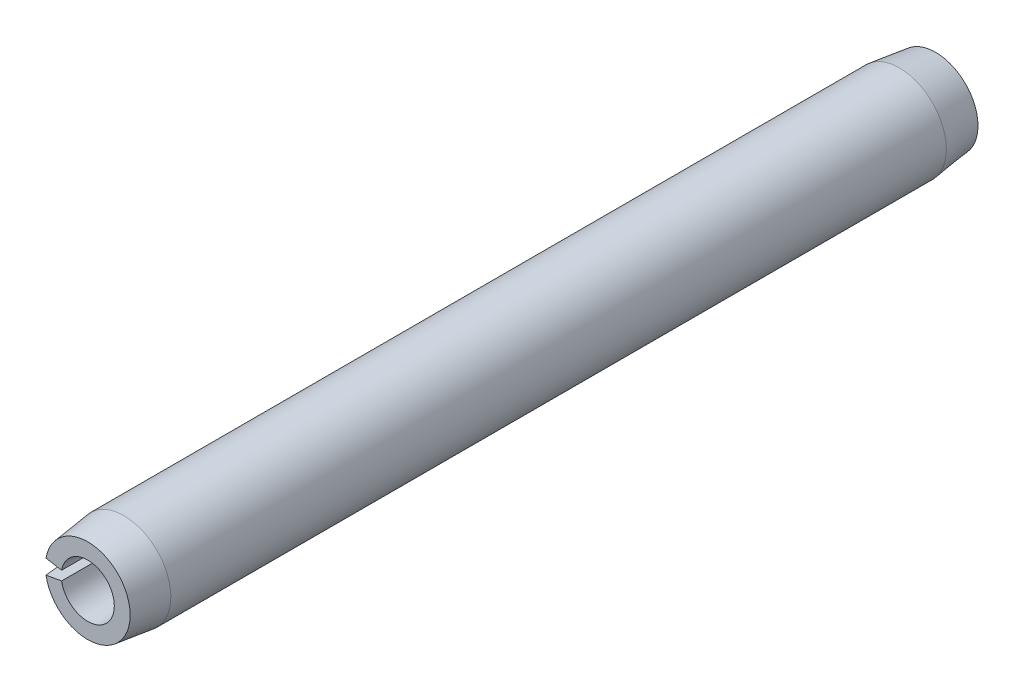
ISO-10303-21;
HEADER;
FILE_DESCRIPTION(('STEP AP214'),'2;1');
FILE_NAME('part.step','',(''),(''),'','','');
FILE_SCHEMA(('AUTOMOTIVE_DESIGN { 1 0 10303 214 1 1 1 1 }'));
ENDSEC;
DATA;
#1=APPLICATION_CONTEXT('core data for automotive mechanical design processes');
#2=APPLICATION_PROTOCOL_DEFINITION('international standard','automotive_design',2000,#1);
#3=PRODUCT_CONTEXT('',#1,'mechanical');
#4=PRODUCT('Part','Part','',(#3));
#5=PRODUCT_RELATED_PRODUCT_CATEGORY('part','',(#4));
#6=PRODUCT_DEFINITION_FORMATION('','',#4);
#7=PRODUCT_DEFINITION_CONTEXT('part definition',#1,'design');
#8=PRODUCT_DEFINITION('design','',#6,#7);
#9=PRODUCT_DEFINITION_SHAPE('','',#8);
#10=(LENGTH_UNIT() NAMED_UNIT(*) SI_UNIT(.MILLI.,.METRE.));
#11=(NAMED_UNIT(*) PLANE_ANGLE_UNIT() SI_UNIT($,.RADIAN.));
#12=(NAMED_UNIT(*) SI_UNIT($,.STERADIAN.) SOLID_ANGLE_UNIT());
#13=UNCERTAINTY_MEASURE_WITH_UNIT(LENGTH_MEASURE(1.E-05),#10,'distance_accuracy_value','');
#14=(GEOMETRIC_REPRESENTATION_CONTEXT(3) GLOBAL_UNCERTAINTY_ASSIGNED_CONTEXT((#13)) GLOBAL_UNIT_ASSIGNED_CONTEXT((#10,
#11,#12)) REPRESENTATION_CONTEXT('',''));
#15=CARTESIAN_POINT('',(0.,0.,0.));
#16=DIRECTION('',(0.,0.,1.));
#17=DIRECTION('',(1.,0.,0.));
#18=AXIS2_PLACEMENT_3D('',#15,#16,#17);
#19=CARTESIAN_POINT('',(0.,0.,9.525));
#20=DIRECTION('',(0.,0.,1.));
#21=DIRECTION('',(1.,0.,0.));
#22=AXIS2_PLACEMENT_3D('',#19,#20,#21);
#23=PLANE('',#22);
#24=CARTESIAN_POINT('',(0.,0.,9.525));
#25=DIRECTION('',(0.,0.,-1.));
#26=DIRECTION('',(-1.,0.,0.));
#27=AXIS2_PLACEMENT_3D('',#24,#25,#26);
#28=CIRCLE('',#27,0.952500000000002);
#29=CARTESIAN_POINT('',(-0.93802938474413,0.165399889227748,9.525));
#30=VERTEX_POINT('',#29);
#31=CARTESIAN_POINT('',(-0.938029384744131,-0.165399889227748,9.525));
#32=VERTEX_POINT('',#31);
#33=EDGE_CURVE('E118',#30,#32,#28,.T.);
#34=ORIENTED_EDGE('',*,*,#33,.F.);
#35=DIRECTION('',(0.984807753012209,-0.173648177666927,0.));
#36=VECTOR('',#35,1.);
#37=CARTESIAN_POINT('',(-1.03808585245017,0.183042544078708,9.525));
#38=LINE('',#37,#36);
#39=CARTESIAN_POINT('',(-0.587831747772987,0.103650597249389,9.525));
#40=VERTEX_POINT('',#39);
#41=EDGE_CURVE('E139',#30,#40,#38,.T.);
#42=ORIENTED_EDGE('',*,*,#41,.T.);
#43=CARTESIAN_POINT('',(0.,0.,9.525));
#44=DIRECTION('',(0.,0.,-1.));
#45=DIRECTION('',(1.,0.,0.));
#46=AXIS2_PLACEMENT_3D('',#43,#44,#45);
#47=CIRCLE('',#46,0.5969);
#48=CARTESIAN_POINT('',(-0.587831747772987,-0.103650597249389,9.525));
#49=VERTEX_POINT('',#48);
#50=EDGE_CURVE('E138',#40,#49,#47,.T.);
#51=ORIENTED_EDGE('',*,*,#50,.T.);
#52=DIRECTION('',(-0.984807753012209,-0.173648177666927,0.));
#53=VECTOR('',#52,1.);
#54=CARTESIAN_POINT('',(-0.587831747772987,-0.103650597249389,9.525));
#55=LINE('',#54,#53);
#56=EDGE_CURVE('E132',#49,#32,#55,.T.);
#57=ORIENTED_EDGE('',*,*,#56,.T.);
#58=EDGE_LOOP('',(#34,#42,#51,#57));
#59=FACE_BOUND('',#58,.T.);
#60=ADVANCED_FACE('F66',(#59),#23,.T.);
#61=CARTESIAN_POINT('',(0.,0.,-9.525));
#62=DIRECTION('',(0.,0.,1.));
#63=DIRECTION('',(1.,0.,0.));
#64=AXIS2_PLACEMENT_3D('',#61,#62,#63);
#65=CYLINDRICAL_SURFACE('',#64,0.5969);
#66=DIRECTION('',(0.,0.,1.));
#67=VECTOR('',#66,1.);
#68=CARTESIAN_POINT('',(-0.587831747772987,-0.103650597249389,-9.525));
#69=LINE('',#68,#67);
#70=CARTESIAN_POINT('',(-0.587831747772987,-0.103650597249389,-9.525));
#71=VERTEX_POINT('',#70);
#72=EDGE_CURVE('E70',#71,#49,#69,.T.);
#73=ORIENTED_EDGE('',*,*,#72,.T.);
#74=ORIENTED_EDGE('',*,*,#50,.F.);
#75=DIRECTION('',(0.,0.,1.));
#76=VECTOR('',#75,1.);
#77=CARTESIAN_POINT('',(-0.587831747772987,0.103650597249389,-9.525));
#78=LINE('',#77,#76);
#79=CARTESIAN_POINT('',(-0.587831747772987,0.103650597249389,-9.525));
#80=VERTEX_POINT('',#79);
#81=EDGE_CURVE('E12',#80,#40,#78,.T.);
#82=ORIENTED_EDGE('',*,*,#81,.F.);
#83=CARTESIAN_POINT('',(0.,0.,-9.525));
#84=DIRECTION('',(0.,0.,-1.));
#85=DIRECTION('',(1.,0.,0.));
#86=AXIS2_PLACEMENT_3D('',#83,#84,#85);
#87=CIRCLE('',#86,0.5969);
#88=EDGE_CURVE('E141',#80,#71,#87,.T.);
#89=ORIENTED_EDGE('',*,*,#88,.T.);
#90=EDGE_LOOP('',(#73,#74,#82,#89));
#91=FACE_BOUND('',#90,.T.);
#92=ADVANCED_FACE('F68',(#91),#65,.F.);
#93=CARTESIAN_POINT('',(-1.03808585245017,0.183042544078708,-9.525));
#94=DIRECTION('',(-0.173648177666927,-0.984807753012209,0.));
#95=DIRECTION('',(0.984807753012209,-0.173648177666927,0.));
#96=AXIS2_PLACEMENT_3D('',#93,#94,#95);
#97=PLANE('',#96);
#98=DIRECTION('',(-0.122150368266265,0.0215384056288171,-0.992277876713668));
#99=VECTOR('',#98,1.);
#100=CARTESIAN_POINT('',(0.,0.,17.145));
#101=LINE('',#100,#99);
#102=CARTESIAN_POINT('',(-1.03808585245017,0.183042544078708,8.7122));
#103=VERTEX_POINT('',#102);
#104=EDGE_CURVE('E83',#103,#30,#101,.F.);
#105=ORIENTED_EDGE('',*,*,#104,.F.);
#106=DIRECTION('',(0.,0.,1.));
#107=VECTOR('',#106,1.);
#108=CARTESIAN_POINT('',(-1.03808585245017,0.183042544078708,-9.525));
#109=LINE('',#108,#107);
#110=CARTESIAN_POINT('',(-1.03808585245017,0.183042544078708,-8.7122));
#111=VERTEX_POINT('',#110);
#112=EDGE_CURVE('E75',#111,#103,#109,.T.);
#113=ORIENTED_EDGE('',*,*,#112,.F.);
#114=DIRECTION('',(0.122150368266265,-0.0215384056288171,-0.992277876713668));
#115=VECTOR('',#114,1.);
#116=CARTESIAN_POINT('',(0.,0.,-17.145));
#117=LINE('',#116,#115);
#118=CARTESIAN_POINT('',(-0.938029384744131,0.165399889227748,-9.525));
#119=VERTEX_POINT('',#118);
#120=EDGE_CURVE('E143',#119,#111,#117,.F.);
#121=ORIENTED_EDGE('',*,*,#120,.F.);
#122=DIRECTION('',(0.984807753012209,-0.173648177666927,0.));
#123=VECTOR('',#122,1.);
#124=CARTESIAN_POINT('',(-1.03808585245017,0.183042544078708,-9.525));
#125=LINE('',#124,#123);
#126=EDGE_CURVE('E152',#119,#80,#125,.T.);
#127=ORIENTED_EDGE('',*,*,#126,.T.);
#128=ORIENTED_EDGE('',*,*,#81,.T.);
#129=ORIENTED_EDGE('',*,*,#41,.F.);
#130=EDGE_LOOP('',(#105,#113,#121,#127,#128,#129));
#131=FACE_BOUND('',#130,.T.);
#132=ADVANCED_FACE('F175',(#131),#97,.T.);
#133=CARTESIAN_POINT('',(0.,0.,-9.525));
#134=DIRECTION('',(0.,0.,1.));
#135=DIRECTION('',(1.,0.,0.));
#136=AXIS2_PLACEMENT_3D('',#133,#134,#135);
#137=CYLINDRICAL_SURFACE('',#136,1.0541);
#138=CARTESIAN_POINT('',(0.,0.,8.7122));
#139=DIRECTION('',(0.,0.,-1.));
#140=DIRECTION('',(-1.,0.,0.));
#141=AXIS2_PLACEMENT_3D('',#138,#139,#140);
#142=CIRCLE('',#141,1.0541);
#143=CARTESIAN_POINT('',(-1.03808585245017,-0.183042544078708,8.7122));
#144=VERTEX_POINT('',#143);
#145=EDGE_CURVE('E126',#103,#144,#142,.T.);
#146=ORIENTED_EDGE('',*,*,#145,.T.);
#147=DIRECTION('',(0.,0.,1.));
#148=VECTOR('',#147,1.);
#149=CARTESIAN_POINT('',(-1.03808585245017,-0.183042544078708,-9.525));
#150=LINE('',#149,#148);
#151=CARTESIAN_POINT('',(-1.03808585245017,-0.183042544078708,-8.7122));
#152=VERTEX_POINT('',#151);
#153=EDGE_CURVE('E135',#152,#144,#150,.T.);
#154=ORIENTED_EDGE('',*,*,#153,.F.);
#155=CARTESIAN_POINT('',(0.,0.,-8.7122));
#156=DIRECTION('',(0.,0.,-1.));
#157=DIRECTION('',(-1.,0.,0.));
#158=AXIS2_PLACEMENT_3D('',#155,#156,#157);
#159=CIRCLE('',#158,1.0541);
#160=EDGE_CURVE('E164',#111,#152,#159,.T.);
#161=ORIENTED_EDGE('',*,*,#160,.F.);
#162=ORIENTED_EDGE('',*,*,#112,.T.);
#163=EDGE_LOOP('',(#146,#154,#161,#162));
#164=FACE_BOUND('',#163,.T.);
#165=ADVANCED_FACE('F174',(#164),#137,.T.);
#166=CARTESIAN_POINT('',(-0.587831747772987,-0.103650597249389,-9.525));
#167=DIRECTION('',(-0.173648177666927,0.984807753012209,0.));
#168=DIRECTION('',(-0.984807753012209,-0.173648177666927,0.));
#169=AXIS2_PLACEMENT_3D('',#166,#167,#168);
#170=PLANE('',#169);
#171=DIRECTION('',(0.122150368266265,0.0215384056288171,0.992277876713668));
#172=VECTOR('',#171,1.);
#173=CARTESIAN_POINT('',(0.,0.,17.145));
#174=LINE('',#173,#172);
#175=EDGE_CURVE('E121',#32,#144,#174,.F.);
#176=ORIENTED_EDGE('',*,*,#175,.F.);
#177=ORIENTED_EDGE('',*,*,#56,.F.);
#178=ORIENTED_EDGE('',*,*,#72,.F.);
#179=DIRECTION('',(-0.984807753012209,-0.173648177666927,0.));
#180=VECTOR('',#179,1.);
#181=CARTESIAN_POINT('',(-0.587831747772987,-0.103650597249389,-9.525));
#182=LINE('',#181,#180);
#183=CARTESIAN_POINT('',(-0.938029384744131,-0.165399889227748,-9.525));
#184=VERTEX_POINT('',#183);
#185=EDGE_CURVE('E149',#71,#184,#182,.T.);
#186=ORIENTED_EDGE('',*,*,#185,.T.);
#187=DIRECTION('',(-0.122150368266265,-0.0215384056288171,0.992277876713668));
#188=VECTOR('',#187,1.);
#189=CARTESIAN_POINT('',(0.,0.,-17.145));
#190=LINE('',#189,#188);
#191=EDGE_CURVE('E91',#152,#184,#190,.F.);
#192=ORIENTED_EDGE('',*,*,#191,.F.);
#193=ORIENTED_EDGE('',*,*,#153,.T.);
#194=EDGE_LOOP('',(#176,#177,#178,#186,#192,#193));
#195=FACE_BOUND('',#194,.T.);
#196=ADVANCED_FACE('F131',(#195),#170,.T.);
#197=CARTESIAN_POINT('',(0.,0.,-9.525));
#198=DIRECTION('',(0.,0.,1.));
#199=DIRECTION('',(1.,0.,0.));
#200=AXIS2_PLACEMENT_3D('',#197,#198,#199);
#201=PLANE('',#200);
#202=ORIENTED_EDGE('',*,*,#126,.F.);
#203=CARTESIAN_POINT('',(0.,0.,-9.525));
#204=DIRECTION('',(0.,0.,-1.));
#205=DIRECTION('',(-1.,0.,0.));
#206=AXIS2_PLACEMENT_3D('',#203,#204,#205);
#207=CIRCLE('',#206,0.952500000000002);
#208=EDGE_CURVE('E162',#119,#184,#207,.T.);
#209=ORIENTED_EDGE('',*,*,#208,.T.);
#210=ORIENTED_EDGE('',*,*,#185,.F.);
#211=ORIENTED_EDGE('',*,*,#88,.F.);
#212=EDGE_LOOP('',(#202,#209,#210,#211));
#213=FACE_BOUND('',#212,.T.);
#214=ADVANCED_FACE('F161',(#213),#201,.F.);
#215=CARTESIAN_POINT('',(0.,0.,-8.7122));
#216=DIRECTION('',(0.,0.,1.));
#217=DIRECTION('',(1.,0.,0.));
#218=AXIS2_PLACEMENT_3D('',#215,#216,#217);
#219=CONICAL_SURFACE('',#218,1.0541,0.124354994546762);
#220=ORIENTED_EDGE('',*,*,#120,.T.);
#221=ORIENTED_EDGE('',*,*,#160,.T.);
#222=ORIENTED_EDGE('',*,*,#191,.T.);
#223=ORIENTED_EDGE('',*,*,#208,.F.);
#224=EDGE_LOOP('',(#220,#221,#222,#223));
#225=FACE_BOUND('',#224,.T.);
#226=ADVANCED_FACE('F170',(#225),#219,.T.);
#227=CARTESIAN_POINT('',(0.,0.,8.7122));
#228=DIRECTION('',(0.,0.,-1.));
#229=DIRECTION('',(1.,0.,0.));
#230=AXIS2_PLACEMENT_3D('',#227,#228,#229);
#231=CONICAL_SURFACE('',#230,1.0541,0.124354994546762);
#232=ORIENTED_EDGE('',*,*,#104,.T.);
#233=ORIENTED_EDGE('',*,*,#33,.T.);
#234=ORIENTED_EDGE('',*,*,#175,.T.);
#235=ORIENTED_EDGE('',*,*,#145,.F.);
#236=EDGE_LOOP('',(#232,#233,#234,#235));
#237=FACE_BOUND('',#236,.T.);
#238=ADVANCED_FACE('F120',(#237),#231,.T.);
#239=CLOSED_SHELL('',(#60,#92,#132,#165,#196,#214,#226,#238));
#240=MANIFOLD_SOLID_BREP('B2',#239);
#241=ADVANCED_BREP_SHAPE_REPRESENTATION('',(#18,#240),#14);
#242=SHAPE_DEFINITION_REPRESENTATION(#9,#241);
ENDSEC;
END-ISO-10303-21;
